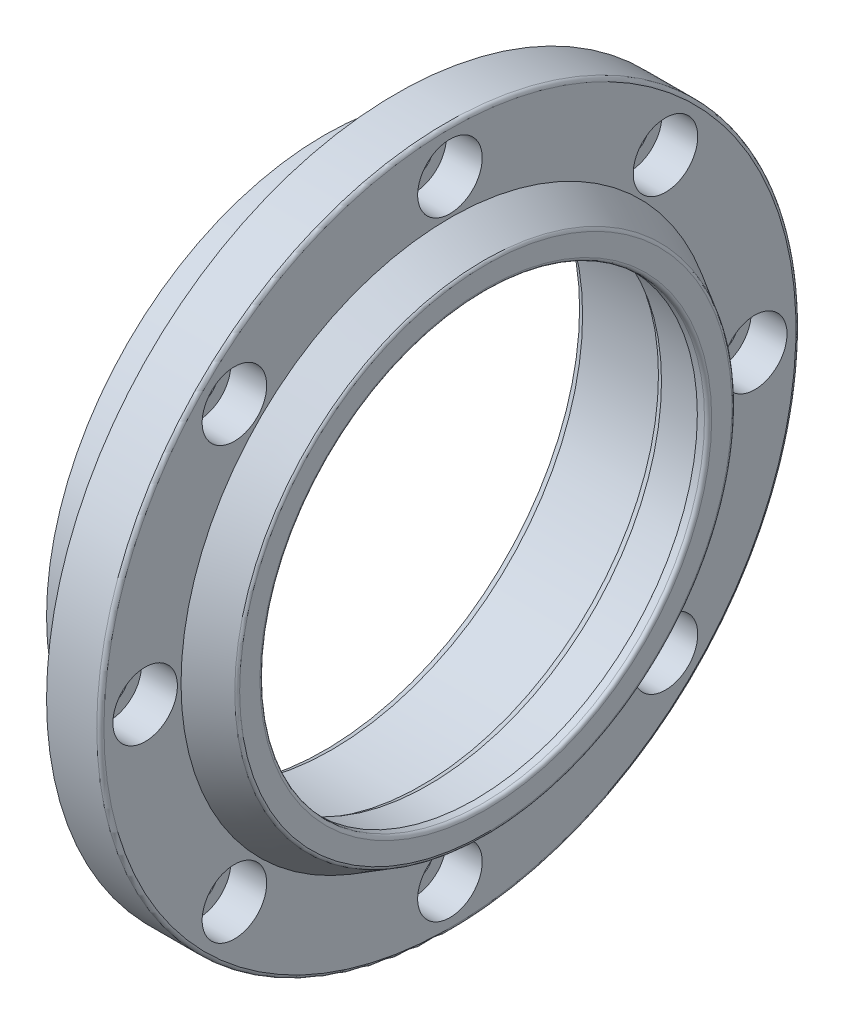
ISO-10303-21;
HEADER;
FILE_DESCRIPTION(('STEP AP214'),'2;1');
FILE_NAME('part.step','',(''),(''),'','','');
FILE_SCHEMA(('AUTOMOTIVE_DESIGN { 1 0 10303 214 1 1 1 1 }'));
ENDSEC;
DATA;
#1=APPLICATION_CONTEXT('core data for automotive mechanical design processes');
#2=APPLICATION_PROTOCOL_DEFINITION('international standard','automotive_design',2000,#1);
#3=PRODUCT_CONTEXT('',#1,'mechanical');
#4=PRODUCT('Part','Part','',(#3));
#5=PRODUCT_RELATED_PRODUCT_CATEGORY('part','',(#4));
#6=PRODUCT_DEFINITION_FORMATION('','',#4);
#7=PRODUCT_DEFINITION_CONTEXT('part definition',#1,'design');
#8=PRODUCT_DEFINITION('design','',#6,#7);
#9=PRODUCT_DEFINITION_SHAPE('','',#8);
#10=(LENGTH_UNIT() NAMED_UNIT(*) SI_UNIT(.MILLI.,.METRE.));
#11=(NAMED_UNIT(*) PLANE_ANGLE_UNIT() SI_UNIT($,.RADIAN.));
#12=(NAMED_UNIT(*) SI_UNIT($,.STERADIAN.) SOLID_ANGLE_UNIT());
#13=UNCERTAINTY_MEASURE_WITH_UNIT(LENGTH_MEASURE(1.E-05),#10,'distance_accuracy_value','');
#14=(GEOMETRIC_REPRESENTATION_CONTEXT(3) GLOBAL_UNCERTAINTY_ASSIGNED_CONTEXT((#13)) GLOBAL_UNIT_ASSIGNED_CONTEXT((#10,
#11,#12)) REPRESENTATION_CONTEXT('',''));
#15=CARTESIAN_POINT('',(0.,0.,0.));
#16=DIRECTION('',(0.,0.,1.));
#17=DIRECTION('',(1.,0.,0.));
#18=AXIS2_PLACEMENT_3D('',#15,#16,#17);
#19=CARTESIAN_POINT('',(35.,75.,0.));
#20=DIRECTION('',(-1.,0.,0.));
#21=DIRECTION('',(0.,0.,1.));
#22=AXIS2_PLACEMENT_3D('',#19,#20,#21);
#23=PLANE('',#22);
#24=CARTESIAN_POINT('',(35.,8.90328257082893E-13,-85.));
#25=DIRECTION('',(1.,0.,0.));
#26=DIRECTION('',(0.,0.,-1.));
#27=AXIS2_PLACEMENT_3D('',#24,#25,#26);
#28=CIRCLE('',#27,9.);
#29=CARTESIAN_POINT('',(35.,8.90328257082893E-13,-94.));
#30=VERTEX_POINT('',#29);
#31=EDGE_CURVE('E80',#30,#30,#28,.T.);
#32=ORIENTED_EDGE('',*,*,#31,.F.);
#33=EDGE_LOOP('',(#32));
#34=FACE_BOUND('',#33,.T.);
#35=CARTESIAN_POINT('',(35.,0.,0.));
#36=DIRECTION('',(-1.,0.,0.));
#37=DIRECTION('',(0.,0.,1.));
#38=AXIS2_PLACEMENT_3D('',#35,#36,#37);
#39=CIRCLE('',#38,75.);
#40=CARTESIAN_POINT('',(35.,0.,75.));
#41=VERTEX_POINT('',#40);
#42=EDGE_CURVE('E155',#41,#41,#39,.T.);
#43=ORIENTED_EDGE('',*,*,#42,.T.);
#44=EDGE_LOOP('',(#43));
#45=FACE_BOUND('',#44,.T.);
#46=CARTESIAN_POINT('',(35.,0.,0.));
#47=DIRECTION('',(-1.,0.,0.));
#48=DIRECTION('',(0.,0.,1.));
#49=AXIS2_PLACEMENT_3D('',#46,#47,#48);
#50=CIRCLE('',#49,96.5);
#51=CARTESIAN_POINT('',(35.,0.,96.5));
#52=VERTEX_POINT('',#51);
#53=EDGE_CURVE('E182',#52,#52,#50,.F.);
#54=ORIENTED_EDGE('',*,*,#53,.T.);
#55=EDGE_LOOP('',(#54));
#56=FACE_BOUND('',#55,.T.);
#57=CARTESIAN_POINT('',(35.,85.,0.));
#58=DIRECTION('',(1.,0.,0.));
#59=DIRECTION('',(0.,0.,-1.));
#60=AXIS2_PLACEMENT_3D('',#57,#58,#59);
#61=CIRCLE('',#60,8.99999999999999);
#62=CARTESIAN_POINT('',(35.,85.,-8.99999999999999));
#63=VERTEX_POINT('',#62);
#64=EDGE_CURVE('E52',#63,#63,#61,.T.);
#65=ORIENTED_EDGE('',*,*,#64,.F.);
#66=EDGE_LOOP('',(#65));
#67=FACE_BOUND('',#66,.T.);
#68=CARTESIAN_POINT('',(35.,60.1040764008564,60.1040764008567));
#69=DIRECTION('',(1.,0.,0.));
#70=DIRECTION('',(0.,0.,-1.));
#71=AXIS2_PLACEMENT_3D('',#68,#69,#70);
#72=CIRCLE('',#71,8.99999999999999);
#73=CARTESIAN_POINT('',(35.,60.1040764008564,51.1040764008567));
#74=VERTEX_POINT('',#73);
#75=EDGE_CURVE('E57',#74,#74,#72,.T.);
#76=ORIENTED_EDGE('',*,*,#75,.F.);
#77=EDGE_LOOP('',(#76));
#78=FACE_BOUND('',#77,.T.);
#79=CARTESIAN_POINT('',(35.,-2.96776085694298E-13,85.));
#80=DIRECTION('',(1.,0.,0.));
#81=DIRECTION('',(0.,0.,-1.));
#82=AXIS2_PLACEMENT_3D('',#79,#80,#81);
#83=CIRCLE('',#82,9.);
#84=CARTESIAN_POINT('',(35.,-2.96776085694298E-13,76.));
#85=VERTEX_POINT('',#84);
#86=EDGE_CURVE('E62',#85,#85,#83,.T.);
#87=ORIENTED_EDGE('',*,*,#86,.F.);
#88=EDGE_LOOP('',(#87));
#89=FACE_BOUND('',#88,.T.);
#90=CARTESIAN_POINT('',(35.,-60.1040764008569,60.1040764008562));
#91=DIRECTION('',(1.,0.,0.));
#92=DIRECTION('',(0.,0.,-1.));
#93=AXIS2_PLACEMENT_3D('',#90,#91,#92);
#94=CIRCLE('',#93,9.);
#95=CARTESIAN_POINT('',(35.,-60.1040764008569,51.1040764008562));
#96=VERTEX_POINT('',#95);
#97=EDGE_CURVE('E67',#96,#96,#94,.T.);
#98=ORIENTED_EDGE('',*,*,#97,.F.);
#99=EDGE_LOOP('',(#98));
#100=FACE_BOUND('',#99,.T.);
#101=CARTESIAN_POINT('',(35.,-85.,-5.93552171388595E-13));
#102=DIRECTION('',(1.,0.,0.));
#103=DIRECTION('',(0.,0.,-1.));
#104=AXIS2_PLACEMENT_3D('',#101,#102,#103);
#105=CIRCLE('',#104,8.99999999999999);
#106=CARTESIAN_POINT('',(35.,-85.,-9.00000000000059));
#107=VERTEX_POINT('',#106);
#108=EDGE_CURVE('E72',#107,#107,#105,.T.);
#109=ORIENTED_EDGE('',*,*,#108,.F.);
#110=EDGE_LOOP('',(#109));
#111=FACE_BOUND('',#110,.T.);
#112=CARTESIAN_POINT('',(35.,-60.104076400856,-60.1040764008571));
#113=DIRECTION('',(1.,0.,0.));
#114=DIRECTION('',(0.,0.,-1.));
#115=AXIS2_PLACEMENT_3D('',#112,#113,#114);
#116=CIRCLE('',#115,9.);
#117=CARTESIAN_POINT('',(35.,-60.104076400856,-69.1040764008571));
#118=VERTEX_POINT('',#117);
#119=EDGE_CURVE('E76',#118,#118,#116,.T.);
#120=ORIENTED_EDGE('',*,*,#119,.F.);
#121=EDGE_LOOP('',(#120));
#122=FACE_BOUND('',#121,.T.);
#123=CARTESIAN_POINT('',(35.,60.1040764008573,-60.1040764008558));
#124=DIRECTION('',(1.,0.,0.));
#125=DIRECTION('',(0.,0.,-1.));
#126=AXIS2_PLACEMENT_3D('',#123,#124,#125);
#127=CIRCLE('',#126,9.);
#128=CARTESIAN_POINT('',(35.,60.1040764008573,-69.1040764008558));
#129=VERTEX_POINT('',#128);
#130=EDGE_CURVE('E351',#129,#129,#127,.T.);
#131=ORIENTED_EDGE('',*,*,#130,.F.);
#132=EDGE_LOOP('',(#131));
#133=FACE_BOUND('',#132,.T.);
#134=ADVANCED_FACE('F31',(#34,#45,#56,#67,#78,#89,#100,#111,#122,#133),#23,.F.);
#135=CARTESIAN_POINT('',(0.,77.5,0.));
#136=DIRECTION('',(1.,0.,0.));
#137=DIRECTION('',(0.,0.,-1.));
#138=AXIS2_PLACEMENT_3D('',#135,#136,#137);
#139=PLANE('',#138);
#140=CARTESIAN_POINT('',(0.,0.,0.));
#141=DIRECTION('',(1.,0.,0.));
#142=DIRECTION('',(0.,0.,-1.));
#143=AXIS2_PLACEMENT_3D('',#140,#141,#142);
#144=CIRCLE('',#143,71.1547005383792);
#145=CARTESIAN_POINT('',(0.,0.,-71.1547005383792));
#146=VERTEX_POINT('',#145);
#147=EDGE_CURVE('E176',#146,#146,#144,.T.);
#148=ORIENTED_EDGE('',*,*,#147,.T.);
#149=EDGE_LOOP('',(#148));
#150=FACE_BOUND('',#149,.T.);
#151=CARTESIAN_POINT('',(0.,0.,0.));
#152=DIRECTION('',(-1.,0.,0.));
#153=DIRECTION('',(0.,0.,1.));
#154=AXIS2_PLACEMENT_3D('',#151,#152,#153);
#155=CIRCLE('',#154,77.5);
#156=CARTESIAN_POINT('',(0.,0.,77.5));
#157=VERTEX_POINT('',#156);
#158=EDGE_CURVE('E51',#157,#157,#155,.T.);
#159=ORIENTED_EDGE('',*,*,#158,.T.);
#160=EDGE_LOOP('',(#159));
#161=FACE_BOUND('',#160,.T.);
#162=ADVANCED_FACE('F33',(#150,#161),#139,.F.);
#163=CARTESIAN_POINT('',(0.,0.,0.));
#164=DIRECTION('',(-1.,0.,0.));
#165=DIRECTION('',(0.,0.,1.));
#166=AXIS2_PLACEMENT_3D('',#163,#164,#165);
#167=CYLINDRICAL_SURFACE('',#166,70.);
#168=CARTESIAN_POINT('',(1.99999999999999,0.,0.));
#169=DIRECTION('',(1.,0.,0.));
#170=DIRECTION('',(0.,0.,-1.));
#171=AXIS2_PLACEMENT_3D('',#168,#169,#170);
#172=CIRCLE('',#171,70.);
#173=CARTESIAN_POINT('',(1.99999999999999,0.,-70.));
#174=VERTEX_POINT('',#173);
#175=EDGE_CURVE('E173',#174,#174,#172,.F.);
#176=ORIENTED_EDGE('',*,*,#175,.T.);
#177=EDGE_LOOP('',(#176));
#178=FACE_BOUND('',#177,.T.);
#179=CARTESIAN_POINT('',(27.,0.,0.));
#180=DIRECTION('',(-1.,0.,0.));
#181=DIRECTION('',(0.,0.,1.));
#182=AXIS2_PLACEMENT_3D('',#179,#180,#181);
#183=CIRCLE('',#182,70.);
#184=CARTESIAN_POINT('',(27.,0.,70.));
#185=VERTEX_POINT('',#184);
#186=EDGE_CURVE('E164',#185,#185,#183,.T.);
#187=ORIENTED_EDGE('',*,*,#186,.F.);
#188=EDGE_LOOP('',(#187));
#189=FACE_BOUND('',#188,.T.);
#190=ADVANCED_FACE('F216',(#178,#189),#167,.F.);
#191=CARTESIAN_POINT('',(27.,70.,0.));
#192=DIRECTION('',(1.,0.,0.));
#193=DIRECTION('',(0.,0.,-1.));
#194=AXIS2_PLACEMENT_3D('',#191,#192,#193);
#195=PLANE('',#194);
#196=CARTESIAN_POINT('',(27.,0.,0.));
#197=DIRECTION('',(1.,0.,0.));
#198=DIRECTION('',(0.,0.,-1.));
#199=AXIS2_PLACEMENT_3D('',#196,#197,#198);
#200=CIRCLE('',#199,66.1547005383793);
#201=CARTESIAN_POINT('',(27.,0.,-66.1547005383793));
#202=VERTEX_POINT('',#201);
#203=EDGE_CURVE('E170',#202,#202,#200,.T.);
#204=ORIENTED_EDGE('',*,*,#203,.T.);
#205=EDGE_LOOP('',(#204));
#206=FACE_BOUND('',#205,.T.);
#207=ORIENTED_EDGE('',*,*,#186,.T.);
#208=EDGE_LOOP('',(#207));
#209=FACE_BOUND('',#208,.T.);
#210=ADVANCED_FACE('F239',(#206,#209),#195,.F.);
#211=CARTESIAN_POINT('',(0.,0.,0.));
#212=DIRECTION('',(-1.,0.,0.));
#213=DIRECTION('',(0.,0.,1.));
#214=AXIS2_PLACEMENT_3D('',#211,#212,#213);
#215=CYLINDRICAL_SURFACE('',#214,65.);
#216=CARTESIAN_POINT('',(29.0000000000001,0.,0.));
#217=DIRECTION('',(1.,0.,0.));
#218=DIRECTION('',(0.,0.,-1.));
#219=AXIS2_PLACEMENT_3D('',#216,#217,#218);
#220=CIRCLE('',#219,65.);
#221=CARTESIAN_POINT('',(29.0000000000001,0.,-65.));
#222=VERTEX_POINT('',#221);
#223=EDGE_CURVE('E167',#222,#222,#220,.F.);
#224=ORIENTED_EDGE('',*,*,#223,.T.);
#225=EDGE_LOOP('',(#224));
#226=FACE_BOUND('',#225,.T.);
#227=CARTESIAN_POINT('',(42.,0.,0.));
#228=DIRECTION('',(-1.,0.,0.));
#229=DIRECTION('',(0.,0.,1.));
#230=AXIS2_PLACEMENT_3D('',#227,#228,#229);
#231=CIRCLE('',#230,65.);
#232=CARTESIAN_POINT('',(42.,0.,65.));
#233=VERTEX_POINT('',#232);
#234=EDGE_CURVE('E161',#233,#233,#231,.T.);
#235=ORIENTED_EDGE('',*,*,#234,.F.);
#236=EDGE_LOOP('',(#235));
#237=FACE_BOUND('',#236,.T.);
#238=ADVANCED_FACE('F235',(#226,#237),#215,.F.);
#239=CARTESIAN_POINT('',(42.,65.,0.));
#240=DIRECTION('',(1.,0.,0.));
#241=DIRECTION('',(0.,0.,-1.));
#242=AXIS2_PLACEMENT_3D('',#239,#240,#241);
#243=PLANE('',#242);
#244=CARTESIAN_POINT('',(42.,0.,0.));
#245=DIRECTION('',(-1.,0.,0.));
#246=DIRECTION('',(0.,0.,1.));
#247=AXIS2_PLACEMENT_3D('',#244,#245,#246);
#248=CIRCLE('',#247,62.);
#249=CARTESIAN_POINT('',(42.,0.,62.));
#250=VERTEX_POINT('',#249);
#251=EDGE_CURVE('E158',#250,#250,#248,.T.);
#252=ORIENTED_EDGE('',*,*,#251,.F.);
#253=EDGE_LOOP('',(#252));
#254=FACE_BOUND('',#253,.T.);
#255=ORIENTED_EDGE('',*,*,#234,.T.);
#256=EDGE_LOOP('',(#255));
#257=FACE_BOUND('',#256,.T.);
#258=ADVANCED_FACE('F231',(#254,#257),#243,.F.);
#259=CARTESIAN_POINT('',(0.,0.,0.));
#260=DIRECTION('',(-1.,0.,0.));
#261=DIRECTION('',(0.,0.,1.));
#262=AXIS2_PLACEMENT_3D('',#259,#260,#261);
#263=CYLINDRICAL_SURFACE('',#262,62.);
#264=CARTESIAN_POINT('',(44.,0.,0.));
#265=DIRECTION('',(-1.,0.,0.));
#266=DIRECTION('',(0.,0.,1.));
#267=AXIS2_PLACEMENT_3D('',#264,#265,#266);
#268=CIRCLE('',#267,62.);
#269=CARTESIAN_POINT('',(44.,0.,62.));
#270=VERTEX_POINT('',#269);
#271=EDGE_CURVE('E39',#270,#270,#268,.F.);
#272=ORIENTED_EDGE('',*,*,#271,.T.);
#273=EDGE_LOOP('',(#272));
#274=FACE_BOUND('',#273,.T.);
#275=ORIENTED_EDGE('',*,*,#251,.T.);
#276=EDGE_LOOP('',(#275));
#277=FACE_BOUND('',#276,.T.);
#278=ADVANCED_FACE('F228',(#274,#277),#263,.F.);
#279=CARTESIAN_POINT('',(45.,62.,0.));
#280=DIRECTION('',(-1.,0.,0.));
#281=DIRECTION('',(0.,0.,1.));
#282=AXIS2_PLACEMENT_3D('',#279,#280,#281);
#283=PLANE('',#282);
#284=CARTESIAN_POINT('',(45.,0.,0.));
#285=DIRECTION('',(-1.,0.,0.));
#286=DIRECTION('',(0.,0.,1.));
#287=AXIS2_PLACEMENT_3D('',#284,#285,#286);
#288=CIRCLE('',#287,63.);
#289=CARTESIAN_POINT('',(45.,0.,63.));
#290=VERTEX_POINT('',#289);
#291=EDGE_CURVE('E44',#290,#290,#288,.T.);
#292=ORIENTED_EDGE('',*,*,#291,.T.);
#293=EDGE_LOOP('',(#292));
#294=FACE_BOUND('',#293,.T.);
#295=CARTESIAN_POINT('',(45.,0.,0.));
#296=DIRECTION('',(-1.,0.,0.));
#297=DIRECTION('',(0.,0.,1.));
#298=AXIS2_PLACEMENT_3D('',#295,#296,#297);
#299=CIRCLE('',#298,68.6491470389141);
#300=CARTESIAN_POINT('',(45.,0.,68.6491470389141));
#301=VERTEX_POINT('',#300);
#302=EDGE_CURVE('E185',#301,#301,#299,.F.);
#303=ORIENTED_EDGE('',*,*,#302,.T.);
#304=EDGE_LOOP('',(#303));
#305=FACE_BOUND('',#304,.T.);
#306=ADVANCED_FACE('F190',(#294,#305),#283,.F.);
#307=CARTESIAN_POINT('',(45.,0.,0.));
#308=DIRECTION('',(-1.,0.,0.));
#309=DIRECTION('',(0.,0.,1.));
#310=AXIS2_PLACEMENT_3D('',#307,#308,#309);
#311=CONICAL_SURFACE('',#310,69.2264973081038,0.523598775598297);
#312=CARTESIAN_POINT('',(44.5,0.,0.));
#313=DIRECTION('',(1.,0.,0.));
#314=DIRECTION('',(0.,0.,-1.));
#315=AXIS2_PLACEMENT_3D('',#312,#313,#314);
#316=CIRCLE('',#315,69.5151724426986);
#317=CARTESIAN_POINT('',(44.5,0.,-69.5151724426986));
#318=VERTEX_POINT('',#317);
#319=EDGE_CURVE('E10',#318,#318,#316,.F.);
#320=ORIENTED_EDGE('',*,*,#319,.T.);
#321=EDGE_LOOP('',(#320));
#322=FACE_BOUND('',#321,.T.);
#323=ORIENTED_EDGE('',*,*,#42,.F.);
#324=EDGE_LOOP('',(#323));
#325=FACE_BOUND('',#324,.T.);
#326=ADVANCED_FACE('F223',(#322,#325),#311,.T.);
#327=CARTESIAN_POINT('',(0.,0.,0.));
#328=DIRECTION('',(-1.,0.,0.));
#329=DIRECTION('',(0.,0.,1.));
#330=AXIS2_PLACEMENT_3D('',#327,#328,#329);
#331=CYLINDRICAL_SURFACE('',#330,97.5);
#332=CARTESIAN_POINT('',(34.,0.,0.));
#333=DIRECTION('',(-1.,0.,0.));
#334=DIRECTION('',(0.,0.,1.));
#335=AXIS2_PLACEMENT_3D('',#332,#333,#334);
#336=CIRCLE('',#335,97.5);
#337=CARTESIAN_POINT('',(34.,0.,97.5));
#338=VERTEX_POINT('',#337);
#339=EDGE_CURVE('E179',#338,#338,#336,.T.);
#340=ORIENTED_EDGE('',*,*,#339,.T.);
#341=EDGE_LOOP('',(#340));
#342=FACE_BOUND('',#341,.T.);
#343=CARTESIAN_POINT('',(20.,0.,0.));
#344=DIRECTION('',(-1.,0.,0.));
#345=DIRECTION('',(0.,0.,1.));
#346=AXIS2_PLACEMENT_3D('',#343,#344,#345);
#347=CIRCLE('',#346,97.5);
#348=CARTESIAN_POINT('',(20.,0.,97.5));
#349=VERTEX_POINT('',#348);
#350=EDGE_CURVE('E152',#349,#349,#347,.T.);
#351=ORIENTED_EDGE('',*,*,#350,.F.);
#352=EDGE_LOOP('',(#351));
#353=FACE_BOUND('',#352,.T.);
#354=ADVANCED_FACE('F221',(#342,#353),#331,.T.);
#355=CARTESIAN_POINT('',(20.,97.5,0.));
#356=DIRECTION('',(1.,0.,0.));
#357=DIRECTION('',(0.,0.,-1.));
#358=AXIS2_PLACEMENT_3D('',#355,#356,#357);
#359=PLANE('',#358);
#360=CARTESIAN_POINT('',(20.,60.1040764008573,-60.1040764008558));
#361=DIRECTION('',(1.,0.,0.));
#362=DIRECTION('',(0.,0.,-1.));
#363=AXIS2_PLACEMENT_3D('',#360,#361,#362);
#364=CIRCLE('',#363,5.5);
#365=CARTESIAN_POINT('',(20.,60.1040764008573,-65.6040764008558));
#366=VERTEX_POINT('',#365);
#367=EDGE_CURVE('E35',#366,#366,#364,.T.);
#368=ORIENTED_EDGE('',*,*,#367,.T.);
#369=EDGE_LOOP('',(#368));
#370=FACE_BOUND('',#369,.T.);
#371=CARTESIAN_POINT('',(20.,8.90328257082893E-13,-85.));
#372=DIRECTION('',(1.,0.,0.));
#373=DIRECTION('',(0.,0.,-1.));
#374=AXIS2_PLACEMENT_3D('',#371,#372,#373);
#375=CIRCLE('',#374,5.5);
#376=CARTESIAN_POINT('',(20.,8.90328257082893E-13,-90.5));
#377=VERTEX_POINT('',#376);
#378=EDGE_CURVE('E77',#377,#377,#375,.T.);
#379=ORIENTED_EDGE('',*,*,#378,.T.);
#380=EDGE_LOOP('',(#379));
#381=FACE_BOUND('',#380,.T.);
#382=CARTESIAN_POINT('',(20.,-60.104076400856,-60.1040764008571));
#383=DIRECTION('',(1.,0.,0.));
#384=DIRECTION('',(0.,0.,-1.));
#385=AXIS2_PLACEMENT_3D('',#382,#383,#384);
#386=CIRCLE('',#385,5.49999999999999);
#387=CARTESIAN_POINT('',(20.,-60.104076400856,-65.6040764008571));
#388=VERTEX_POINT('',#387);
#389=EDGE_CURVE('E73',#388,#388,#386,.T.);
#390=ORIENTED_EDGE('',*,*,#389,.T.);
#391=EDGE_LOOP('',(#390));
#392=FACE_BOUND('',#391,.T.);
#393=CARTESIAN_POINT('',(20.,-85.,-5.93552171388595E-13));
#394=DIRECTION('',(1.,0.,0.));
#395=DIRECTION('',(0.,0.,-1.));
#396=AXIS2_PLACEMENT_3D('',#393,#394,#395);
#397=CIRCLE('',#396,5.5);
#398=CARTESIAN_POINT('',(20.,-85.,-5.50000000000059));
#399=VERTEX_POINT('',#398);
#400=EDGE_CURVE('E68',#399,#399,#397,.T.);
#401=ORIENTED_EDGE('',*,*,#400,.T.);
#402=EDGE_LOOP('',(#401));
#403=FACE_BOUND('',#402,.T.);
#404=CARTESIAN_POINT('',(20.,-60.1040764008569,60.1040764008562));
#405=DIRECTION('',(1.,0.,0.));
#406=DIRECTION('',(0.,0.,-1.));
#407=AXIS2_PLACEMENT_3D('',#404,#405,#406);
#408=CIRCLE('',#407,5.49999999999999);
#409=CARTESIAN_POINT('',(20.,-60.1040764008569,54.6040764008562));
#410=VERTEX_POINT('',#409);
#411=EDGE_CURVE('E63',#410,#410,#408,.T.);
#412=ORIENTED_EDGE('',*,*,#411,.T.);
#413=EDGE_LOOP('',(#412));
#414=FACE_BOUND('',#413,.T.);
#415=CARTESIAN_POINT('',(20.,-2.96776085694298E-13,85.));
#416=DIRECTION('',(1.,0.,0.));
#417=DIRECTION('',(0.,0.,-1.));
#418=AXIS2_PLACEMENT_3D('',#415,#416,#417);
#419=CIRCLE('',#418,5.5);
#420=CARTESIAN_POINT('',(20.,-2.96776085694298E-13,79.5));
#421=VERTEX_POINT('',#420);
#422=EDGE_CURVE('E58',#421,#421,#419,.T.);
#423=ORIENTED_EDGE('',*,*,#422,.T.);
#424=EDGE_LOOP('',(#423));
#425=FACE_BOUND('',#424,.T.);
#426=CARTESIAN_POINT('',(20.,60.1040764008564,60.1040764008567));
#427=DIRECTION('',(1.,0.,0.));
#428=DIRECTION('',(0.,0.,-1.));
#429=AXIS2_PLACEMENT_3D('',#426,#427,#428);
#430=CIRCLE('',#429,5.5);
#431=CARTESIAN_POINT('',(20.,60.1040764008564,54.6040764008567));
#432=VERTEX_POINT('',#431);
#433=EDGE_CURVE('E53',#432,#432,#430,.T.);
#434=ORIENTED_EDGE('',*,*,#433,.T.);
#435=EDGE_LOOP('',(#434));
#436=FACE_BOUND('',#435,.T.);
#437=CARTESIAN_POINT('',(20.,85.,0.));
#438=DIRECTION('',(1.,0.,0.));
#439=DIRECTION('',(0.,0.,-1.));
#440=AXIS2_PLACEMENT_3D('',#437,#438,#439);
#441=CIRCLE('',#440,5.5);
#442=CARTESIAN_POINT('',(20.,85.,-5.5));
#443=VERTEX_POINT('',#442);
#444=EDGE_CURVE('E48',#443,#443,#441,.T.);
#445=ORIENTED_EDGE('',*,*,#444,.T.);
#446=EDGE_LOOP('',(#445));
#447=FACE_BOUND('',#446,.T.);
#448=CARTESIAN_POINT('',(20.,0.,0.));
#449=DIRECTION('',(-1.,0.,0.));
#450=DIRECTION('',(0.,0.,1.));
#451=AXIS2_PLACEMENT_3D('',#448,#449,#450);
#452=CIRCLE('',#451,77.5);
#453=CARTESIAN_POINT('',(20.,0.,77.5));
#454=VERTEX_POINT('',#453);
#455=EDGE_CURVE('E149',#454,#454,#452,.T.);
#456=ORIENTED_EDGE('',*,*,#455,.F.);
#457=EDGE_LOOP('',(#456));
#458=FACE_BOUND('',#457,.T.);
#459=ORIENTED_EDGE('',*,*,#350,.T.);
#460=EDGE_LOOP('',(#459));
#461=FACE_BOUND('',#460,.T.);
#462=ADVANCED_FACE('F281',(#370,#381,#392,#403,#414,#425,#436,#447,#458,#461),#359,.F.);
#463=CARTESIAN_POINT('',(0.,0.,0.));
#464=DIRECTION('',(-1.,0.,0.));
#465=DIRECTION('',(0.,0.,1.));
#466=AXIS2_PLACEMENT_3D('',#463,#464,#465);
#467=CYLINDRICAL_SURFACE('',#466,77.5);
#468=CARTESIAN_POINT('',(11.8,0.,0.));
#469=DIRECTION('',(-1.,0.,0.));
#470=DIRECTION('',(0.,0.,1.));
#471=AXIS2_PLACEMENT_3D('',#468,#469,#470);
#472=CIRCLE('',#471,77.5);
#473=CARTESIAN_POINT('',(11.8,0.,77.5));
#474=VERTEX_POINT('',#473);
#475=EDGE_CURVE('E146',#474,#474,#472,.T.);
#476=ORIENTED_EDGE('',*,*,#475,.F.);
#477=EDGE_LOOP('',(#476));
#478=FACE_BOUND('',#477,.T.);
#479=ORIENTED_EDGE('',*,*,#455,.T.);
#480=EDGE_LOOP('',(#479));
#481=FACE_BOUND('',#480,.T.);
#482=ADVANCED_FACE('F278',(#478,#481),#467,.T.);
#483=CARTESIAN_POINT('',(11.8,77.5,0.));
#484=DIRECTION('',(1.,0.,0.));
#485=DIRECTION('',(0.,0.,-1.));
#486=AXIS2_PLACEMENT_3D('',#483,#484,#485);
#487=PLANE('',#486);
#488=CARTESIAN_POINT('',(11.8,0.,0.));
#489=DIRECTION('',(-1.,0.,0.));
#490=DIRECTION('',(0.,0.,1.));
#491=AXIS2_PLACEMENT_3D('',#488,#489,#490);
#492=CIRCLE('',#491,74.4);
#493=CARTESIAN_POINT('',(11.8,0.,74.4));
#494=VERTEX_POINT('',#493);
#495=EDGE_CURVE('E143',#494,#494,#492,.T.);
#496=ORIENTED_EDGE('',*,*,#495,.F.);
#497=EDGE_LOOP('',(#496));
#498=FACE_BOUND('',#497,.T.);
#499=ORIENTED_EDGE('',*,*,#475,.T.);
#500=EDGE_LOOP('',(#499));
#501=FACE_BOUND('',#500,.T.);
#502=ADVANCED_FACE('F274',(#498,#501),#487,.F.);
#503=CARTESIAN_POINT('',(0.,0.,0.));
#504=DIRECTION('',(-1.,0.,0.));
#505=DIRECTION('',(0.,0.,1.));
#506=AXIS2_PLACEMENT_3D('',#503,#504,#505);
#507=CYLINDRICAL_SURFACE('',#506,74.4);
#508=CARTESIAN_POINT('',(7.,0.,0.));
#509=DIRECTION('',(-1.,0.,0.));
#510=DIRECTION('',(0.,0.,1.));
#511=AXIS2_PLACEMENT_3D('',#508,#509,#510);
#512=CIRCLE('',#511,74.4);
#513=CARTESIAN_POINT('',(7.,0.,74.4));
#514=VERTEX_POINT('',#513);
#515=EDGE_CURVE('E140',#514,#514,#512,.T.);
#516=ORIENTED_EDGE('',*,*,#515,.F.);
#517=EDGE_LOOP('',(#516));
#518=FACE_BOUND('',#517,.T.);
#519=ORIENTED_EDGE('',*,*,#495,.T.);
#520=EDGE_LOOP('',(#519));
#521=FACE_BOUND('',#520,.T.);
#522=ADVANCED_FACE('F270',(#518,#521),#507,.T.);
#523=CARTESIAN_POINT('',(7.,74.4,0.));
#524=DIRECTION('',(-1.,0.,0.));
#525=DIRECTION('',(0.,0.,1.));
#526=AXIS2_PLACEMENT_3D('',#523,#524,#525);
#527=PLANE('',#526);
#528=CARTESIAN_POINT('',(7.,0.,0.));
#529=DIRECTION('',(-1.,0.,0.));
#530=DIRECTION('',(0.,0.,1.));
#531=AXIS2_PLACEMENT_3D('',#528,#529,#530);
#532=CIRCLE('',#531,77.5);
#533=CARTESIAN_POINT('',(7.,0.,77.5));
#534=VERTEX_POINT('',#533);
#535=EDGE_CURVE('E137',#534,#534,#532,.T.);
#536=ORIENTED_EDGE('',*,*,#535,.F.);
#537=EDGE_LOOP('',(#536));
#538=FACE_BOUND('',#537,.T.);
#539=ORIENTED_EDGE('',*,*,#515,.T.);
#540=EDGE_LOOP('',(#539));
#541=FACE_BOUND('',#540,.T.);
#542=ADVANCED_FACE('F266',(#538,#541),#527,.F.);
#543=CARTESIAN_POINT('',(0.,0.,0.));
#544=DIRECTION('',(-1.,0.,0.));
#545=DIRECTION('',(0.,0.,1.));
#546=AXIS2_PLACEMENT_3D('',#543,#544,#545);
#547=CYLINDRICAL_SURFACE('',#546,77.5);
#548=ORIENTED_EDGE('',*,*,#158,.F.);
#549=EDGE_LOOP('',(#548));
#550=FACE_BOUND('',#549,.T.);
#551=ORIENTED_EDGE('',*,*,#535,.T.);
#552=EDGE_LOOP('',(#551));
#553=FACE_BOUND('',#552,.T.);
#554=ADVANCED_FACE('F259',(#550,#553),#547,.T.);
#555=CARTESIAN_POINT('',(29.0000000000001,0.,0.));
#556=DIRECTION('',(-1.,0.,0.));
#557=DIRECTION('',(0.,0.,1.));
#558=AXIS2_PLACEMENT_3D('',#555,#556,#557);
#559=CONICAL_SURFACE('',#558,65.,0.523598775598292);
#560=ORIENTED_EDGE('',*,*,#203,.F.);
#561=EDGE_LOOP('',(#560));
#562=FACE_BOUND('',#561,.T.);
#563=ORIENTED_EDGE('',*,*,#223,.F.);
#564=EDGE_LOOP('',(#563));
#565=FACE_BOUND('',#564,.T.);
#566=ADVANCED_FACE('F253',(#562,#565),#559,.F.);
#567=CARTESIAN_POINT('',(1.99999999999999,0.,0.));
#568=DIRECTION('',(-1.,0.,0.));
#569=DIRECTION('',(0.,0.,1.));
#570=AXIS2_PLACEMENT_3D('',#567,#568,#569);
#571=CONICAL_SURFACE('',#570,70.,0.523598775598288);
#572=ORIENTED_EDGE('',*,*,#147,.F.);
#573=EDGE_LOOP('',(#572));
#574=FACE_BOUND('',#573,.T.);
#575=ORIENTED_EDGE('',*,*,#175,.F.);
#576=EDGE_LOOP('',(#575));
#577=FACE_BOUND('',#576,.T.);
#578=ADVANCED_FACE('F206',(#574,#577),#571,.F.);
#579=CARTESIAN_POINT('',(34.,0.,0.));
#580=DIRECTION('',(-1.,0.,0.));
#581=DIRECTION('',(0.,0.,1.));
#582=AXIS2_PLACEMENT_3D('',#579,#580,#581);
#583=TOROIDAL_SURFACE('',#582,96.5,1.);
#584=ORIENTED_EDGE('',*,*,#53,.F.);
#585=EDGE_LOOP('',(#584));
#586=FACE_BOUND('',#585,.T.);
#587=ORIENTED_EDGE('',*,*,#339,.F.);
#588=EDGE_LOOP('',(#587));
#589=FACE_BOUND('',#588,.T.);
#590=ADVANCED_FACE('F196',(#586,#589),#583,.T.);
#591=CARTESIAN_POINT('',(44.,0.,0.));
#592=DIRECTION('',(-1.,0.,0.));
#593=DIRECTION('',(0.,0.,1.));
#594=AXIS2_PLACEMENT_3D('',#591,#592,#593);
#595=TOROIDAL_SURFACE('',#594,63.,1.);
#596=ORIENTED_EDGE('',*,*,#271,.F.);
#597=EDGE_LOOP('',(#596));
#598=FACE_BOUND('',#597,.T.);
#599=ORIENTED_EDGE('',*,*,#291,.F.);
#600=EDGE_LOOP('',(#599));
#601=FACE_BOUND('',#600,.T.);
#602=ADVANCED_FACE('F193',(#598,#601),#595,.T.);
#603=CARTESIAN_POINT('',(44.,0.,0.));
#604=DIRECTION('',(-1.,0.,0.));
#605=DIRECTION('',(0.,0.,1.));
#606=AXIS2_PLACEMENT_3D('',#603,#604,#605);
#607=TOROIDAL_SURFACE('',#606,68.6491470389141,1.);
#608=ORIENTED_EDGE('',*,*,#302,.F.);
#609=EDGE_LOOP('',(#608));
#610=FACE_BOUND('',#609,.T.);
#611=ORIENTED_EDGE('',*,*,#319,.F.);
#612=EDGE_LOOP('',(#611));
#613=FACE_BOUND('',#612,.T.);
#614=ADVANCED_FACE('F195',(#610,#613),#607,.T.);
#615=CARTESIAN_POINT('',(35.,85.,0.));
#616=DIRECTION('',(1.,0.,0.));
#617=DIRECTION('',(0.,0.,-1.));
#618=AXIS2_PLACEMENT_3D('',#615,#616,#617);
#619=CYLINDRICAL_SURFACE('',#618,5.5);
#620=CARTESIAN_POINT('',(25.,85.,0.));
#621=DIRECTION('',(1.,0.,0.));
#622=DIRECTION('',(0.,0.,-1.));
#623=AXIS2_PLACEMENT_3D('',#620,#621,#622);
#624=CIRCLE('',#623,5.50000000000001);
#625=CARTESIAN_POINT('',(25.,85.,-5.50000000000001));
#626=VERTEX_POINT('',#625);
#627=EDGE_CURVE('E56',#626,#626,#624,.T.);
#628=ORIENTED_EDGE('',*,*,#627,.T.);
#629=EDGE_LOOP('',(#628));
#630=FACE_BOUND('',#629,.T.);
#631=ORIENTED_EDGE('',*,*,#444,.F.);
#632=EDGE_LOOP('',(#631));
#633=FACE_BOUND('',#632,.T.);
#634=ADVANCED_FACE('F203',(#630,#633),#619,.F.);
#635=CARTESIAN_POINT('',(35.,85.,0.));
#636=DIRECTION('',(1.,0.,0.));
#637=DIRECTION('',(0.,0.,-1.));
#638=AXIS2_PLACEMENT_3D('',#635,#636,#637);
#639=CYLINDRICAL_SURFACE('',#638,8.99999999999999);
#640=CARTESIAN_POINT('',(25.,85.,0.));
#641=DIRECTION('',(1.,0.,0.));
#642=DIRECTION('',(0.,0.,-1.));
#643=AXIS2_PLACEMENT_3D('',#640,#641,#642);
#644=CIRCLE('',#643,8.99999999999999);
#645=CARTESIAN_POINT('',(25.,85.,-8.99999999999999));
#646=VERTEX_POINT('',#645);
#647=EDGE_CURVE('E130',#646,#646,#644,.T.);
#648=ORIENTED_EDGE('',*,*,#647,.F.);
#649=EDGE_LOOP('',(#648));
#650=FACE_BOUND('',#649,.T.);
#651=ORIENTED_EDGE('',*,*,#64,.T.);
#652=EDGE_LOOP('',(#651));
#653=FACE_BOUND('',#652,.T.);
#654=ADVANCED_FACE('F311',(#650,#653),#639,.F.);
#655=CARTESIAN_POINT('',(25.,90.5,0.));
#656=DIRECTION('',(-1.,0.,0.));
#657=DIRECTION('',(0.,0.,1.));
#658=AXIS2_PLACEMENT_3D('',#655,#656,#657);
#659=PLANE('',#658);
#660=ORIENTED_EDGE('',*,*,#627,.F.);
#661=EDGE_LOOP('',(#660));
#662=FACE_BOUND('',#661,.T.);
#663=ORIENTED_EDGE('',*,*,#647,.T.);
#664=EDGE_LOOP('',(#663));
#665=FACE_BOUND('',#664,.T.);
#666=ADVANCED_FACE('F317',(#662,#665),#659,.F.);
#667=CARTESIAN_POINT('',(35.,60.1040764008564,60.1040764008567));
#668=DIRECTION('',(1.,0.,0.));
#669=DIRECTION('',(0.,0.,-1.));
#670=AXIS2_PLACEMENT_3D('',#667,#668,#669);
#671=CYLINDRICAL_SURFACE('',#670,5.5);
#672=CARTESIAN_POINT('',(25.,60.1040764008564,60.1040764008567));
#673=DIRECTION('',(1.,0.,0.));
#674=DIRECTION('',(0.,0.,-1.));
#675=AXIS2_PLACEMENT_3D('',#672,#673,#674);
#676=CIRCLE('',#675,5.50000000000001);
#677=CARTESIAN_POINT('',(25.,60.1040764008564,54.6040764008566));
#678=VERTEX_POINT('',#677);
#679=EDGE_CURVE('E61',#678,#678,#676,.T.);
#680=ORIENTED_EDGE('',*,*,#679,.T.);
#681=EDGE_LOOP('',(#680));
#682=FACE_BOUND('',#681,.T.);
#683=ORIENTED_EDGE('',*,*,#433,.F.);
#684=EDGE_LOOP('',(#683));
#685=FACE_BOUND('',#684,.T.);
#686=ADVANCED_FACE('F325',(#682,#685),#671,.F.);
#687=CARTESIAN_POINT('',(35.,60.1040764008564,60.1040764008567));
#688=DIRECTION('',(1.,0.,0.));
#689=DIRECTION('',(0.,0.,-1.));
#690=AXIS2_PLACEMENT_3D('',#687,#688,#689);
#691=CYLINDRICAL_SURFACE('',#690,8.99999999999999);
#692=CARTESIAN_POINT('',(25.,60.1040764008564,60.1040764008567));
#693=DIRECTION('',(1.,0.,0.));
#694=DIRECTION('',(0.,0.,-1.));
#695=AXIS2_PLACEMENT_3D('',#692,#693,#694);
#696=CIRCLE('',#695,8.99999999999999);
#697=CARTESIAN_POINT('',(25.,60.1040764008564,51.1040764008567));
#698=VERTEX_POINT('',#697);
#699=EDGE_CURVE('E123',#698,#698,#696,.T.);
#700=ORIENTED_EDGE('',*,*,#699,.F.);
#701=EDGE_LOOP('',(#700));
#702=FACE_BOUND('',#701,.T.);
#703=ORIENTED_EDGE('',*,*,#75,.T.);
#704=EDGE_LOOP('',(#703));
#705=FACE_BOUND('',#704,.T.);
#706=ADVANCED_FACE('F322',(#702,#705),#691,.F.);
#707=CARTESIAN_POINT('',(25.,65.6040764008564,60.1040764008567));
#708=DIRECTION('',(-1.,0.,0.));
#709=DIRECTION('',(0.,0.,1.));
#710=AXIS2_PLACEMENT_3D('',#707,#708,#709);
#711=PLANE('',#710);
#712=ORIENTED_EDGE('',*,*,#679,.F.);
#713=EDGE_LOOP('',(#712));
#714=FACE_BOUND('',#713,.T.);
#715=ORIENTED_EDGE('',*,*,#699,.T.);
#716=EDGE_LOOP('',(#715));
#717=FACE_BOUND('',#716,.T.);
#718=ADVANCED_FACE('F421',(#714,#717),#711,.F.);
#719=CARTESIAN_POINT('',(35.,-2.96776085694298E-13,85.));
#720=DIRECTION('',(1.,0.,0.));
#721=DIRECTION('',(0.,0.,-1.));
#722=AXIS2_PLACEMENT_3D('',#719,#720,#721);
#723=CYLINDRICAL_SURFACE('',#722,5.5);
#724=CARTESIAN_POINT('',(25.,-2.96776085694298E-13,85.));
#725=DIRECTION('',(1.,0.,0.));
#726=DIRECTION('',(0.,0.,-1.));
#727=AXIS2_PLACEMENT_3D('',#724,#725,#726);
#728=CIRCLE('',#727,5.5);
#729=CARTESIAN_POINT('',(25.,-2.96776085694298E-13,79.5));
#730=VERTEX_POINT('',#729);
#731=EDGE_CURVE('E66',#730,#730,#728,.T.);
#732=ORIENTED_EDGE('',*,*,#731,.T.);
#733=EDGE_LOOP('',(#732));
#734=FACE_BOUND('',#733,.T.);
#735=ORIENTED_EDGE('',*,*,#422,.F.);
#736=EDGE_LOOP('',(#735));
#737=FACE_BOUND('',#736,.T.);
#738=ADVANCED_FACE('F417',(#734,#737),#723,.F.);
#739=CARTESIAN_POINT('',(35.,-2.96776085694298E-13,85.));
#740=DIRECTION('',(1.,0.,0.));
#741=DIRECTION('',(0.,0.,-1.));
#742=AXIS2_PLACEMENT_3D('',#739,#740,#741);
#743=CYLINDRICAL_SURFACE('',#742,9.);
#744=CARTESIAN_POINT('',(25.,-2.96776085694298E-13,85.));
#745=DIRECTION('',(1.,0.,0.));
#746=DIRECTION('',(0.,0.,-1.));
#747=AXIS2_PLACEMENT_3D('',#744,#745,#746);
#748=CIRCLE('',#747,9.);
#749=CARTESIAN_POINT('',(25.,-2.96776085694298E-13,76.));
#750=VERTEX_POINT('',#749);
#751=EDGE_CURVE('E116',#750,#750,#748,.T.);
#752=ORIENTED_EDGE('',*,*,#751,.F.);
#753=EDGE_LOOP('',(#752));
#754=FACE_BOUND('',#753,.T.);
#755=ORIENTED_EDGE('',*,*,#86,.T.);
#756=EDGE_LOOP('',(#755));
#757=FACE_BOUND('',#756,.T.);
#758=ADVANCED_FACE('F420',(#754,#757),#743,.F.);
#759=CARTESIAN_POINT('',(25.,5.4999999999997,85.));
#760=DIRECTION('',(-1.,0.,0.));
#761=DIRECTION('',(0.,0.,1.));
#762=AXIS2_PLACEMENT_3D('',#759,#760,#761);
#763=PLANE('',#762);
#764=ORIENTED_EDGE('',*,*,#731,.F.);
#765=EDGE_LOOP('',(#764));
#766=FACE_BOUND('',#765,.T.);
#767=ORIENTED_EDGE('',*,*,#751,.T.);
#768=EDGE_LOOP('',(#767));
#769=FACE_BOUND('',#768,.T.);
#770=ADVANCED_FACE('F409',(#766,#769),#763,.F.);
#771=CARTESIAN_POINT('',(35.,-60.1040764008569,60.1040764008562));
#772=DIRECTION('',(1.,0.,0.));
#773=DIRECTION('',(0.,0.,-1.));
#774=AXIS2_PLACEMENT_3D('',#771,#772,#773);
#775=CYLINDRICAL_SURFACE('',#774,5.49999999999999);
#776=CARTESIAN_POINT('',(25.,-60.1040764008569,60.1040764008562));
#777=DIRECTION('',(1.,0.,0.));
#778=DIRECTION('',(0.,0.,-1.));
#779=AXIS2_PLACEMENT_3D('',#776,#777,#778);
#780=CIRCLE('',#779,5.5);
#781=CARTESIAN_POINT('',(25.,-60.1040764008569,54.6040764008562));
#782=VERTEX_POINT('',#781);
#783=EDGE_CURVE('E71',#782,#782,#780,.T.);
#784=ORIENTED_EDGE('',*,*,#783,.T.);
#785=EDGE_LOOP('',(#784));
#786=FACE_BOUND('',#785,.T.);
#787=ORIENTED_EDGE('',*,*,#411,.F.);
#788=EDGE_LOOP('',(#787));
#789=FACE_BOUND('',#788,.T.);
#790=ADVANCED_FACE('F405',(#786,#789),#775,.F.);
#791=CARTESIAN_POINT('',(35.,-60.1040764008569,60.1040764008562));
#792=DIRECTION('',(1.,0.,0.));
#793=DIRECTION('',(0.,0.,-1.));
#794=AXIS2_PLACEMENT_3D('',#791,#792,#793);
#795=CYLINDRICAL_SURFACE('',#794,9.);
#796=CARTESIAN_POINT('',(25.,-60.1040764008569,60.1040764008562));
#797=DIRECTION('',(1.,0.,0.));
#798=DIRECTION('',(0.,0.,-1.));
#799=AXIS2_PLACEMENT_3D('',#796,#797,#798);
#800=CIRCLE('',#799,9.);
#801=CARTESIAN_POINT('',(25.,-60.1040764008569,51.1040764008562));
#802=VERTEX_POINT('',#801);
#803=EDGE_CURVE('E109',#802,#802,#800,.T.);
#804=ORIENTED_EDGE('',*,*,#803,.F.);
#805=EDGE_LOOP('',(#804));
#806=FACE_BOUND('',#805,.T.);
#807=ORIENTED_EDGE('',*,*,#97,.T.);
#808=EDGE_LOOP('',(#807));
#809=FACE_BOUND('',#808,.T.);
#810=ADVANCED_FACE('F408',(#806,#809),#795,.F.);
#811=CARTESIAN_POINT('',(25.,-54.6040764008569,60.1040764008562));
#812=DIRECTION('',(-1.,0.,0.));
#813=DIRECTION('',(0.,0.,1.));
#814=AXIS2_PLACEMENT_3D('',#811,#812,#813);
#815=PLANE('',#814);
#816=ORIENTED_EDGE('',*,*,#783,.F.);
#817=EDGE_LOOP('',(#816));
#818=FACE_BOUND('',#817,.T.);
#819=ORIENTED_EDGE('',*,*,#803,.T.);
#820=EDGE_LOOP('',(#819));
#821=FACE_BOUND('',#820,.T.);
#822=ADVANCED_FACE('F397',(#818,#821),#815,.F.);
#823=CARTESIAN_POINT('',(35.,-85.,-5.93552171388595E-13));
#824=DIRECTION('',(1.,0.,0.));
#825=DIRECTION('',(0.,0.,-1.));
#826=AXIS2_PLACEMENT_3D('',#823,#824,#825);
#827=CYLINDRICAL_SURFACE('',#826,5.5);
#828=CARTESIAN_POINT('',(25.,-85.,-5.93552171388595E-13));
#829=DIRECTION('',(1.,0.,0.));
#830=DIRECTION('',(0.,0.,-1.));
#831=AXIS2_PLACEMENT_3D('',#828,#829,#830);
#832=CIRCLE('',#831,5.50000000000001);
#833=CARTESIAN_POINT('',(25.,-85.,-5.5000000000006));
#834=VERTEX_POINT('',#833);
#835=EDGE_CURVE('E75',#834,#834,#832,.T.);
#836=ORIENTED_EDGE('',*,*,#835,.T.);
#837=EDGE_LOOP('',(#836));
#838=FACE_BOUND('',#837,.T.);
#839=ORIENTED_EDGE('',*,*,#400,.F.);
#840=EDGE_LOOP('',(#839));
#841=FACE_BOUND('',#840,.T.);
#842=ADVANCED_FACE('F393',(#838,#841),#827,.F.);
#843=CARTESIAN_POINT('',(35.,-85.,-5.93552171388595E-13));
#844=DIRECTION('',(1.,0.,0.));
#845=DIRECTION('',(0.,0.,-1.));
#846=AXIS2_PLACEMENT_3D('',#843,#844,#845);
#847=CYLINDRICAL_SURFACE('',#846,8.99999999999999);
#848=CARTESIAN_POINT('',(25.,-85.,-5.93552171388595E-13));
#849=DIRECTION('',(1.,0.,0.));
#850=DIRECTION('',(0.,0.,-1.));
#851=AXIS2_PLACEMENT_3D('',#848,#849,#850);
#852=CIRCLE('',#851,8.99999999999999);
#853=CARTESIAN_POINT('',(25.,-85.,-9.00000000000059));
#854=VERTEX_POINT('',#853);
#855=EDGE_CURVE('E102',#854,#854,#852,.T.);
#856=ORIENTED_EDGE('',*,*,#855,.F.);
#857=EDGE_LOOP('',(#856));
#858=FACE_BOUND('',#857,.T.);
#859=ORIENTED_EDGE('',*,*,#108,.T.);
#860=EDGE_LOOP('',(#859));
#861=FACE_BOUND('',#860,.T.);
#862=ADVANCED_FACE('F396',(#858,#861),#847,.F.);
#863=CARTESIAN_POINT('',(25.,-79.5,-5.93552171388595E-13));
#864=DIRECTION('',(-1.,0.,0.));
#865=DIRECTION('',(0.,0.,1.));
#866=AXIS2_PLACEMENT_3D('',#863,#864,#865);
#867=PLANE('',#866);
#868=ORIENTED_EDGE('',*,*,#835,.F.);
#869=EDGE_LOOP('',(#868));
#870=FACE_BOUND('',#869,.T.);
#871=ORIENTED_EDGE('',*,*,#855,.T.);
#872=EDGE_LOOP('',(#871));
#873=FACE_BOUND('',#872,.T.);
#874=ADVANCED_FACE('F385',(#870,#873),#867,.F.);
#875=CARTESIAN_POINT('',(35.,-60.104076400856,-60.1040764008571));
#876=DIRECTION('',(1.,0.,0.));
#877=DIRECTION('',(0.,0.,-1.));
#878=AXIS2_PLACEMENT_3D('',#875,#876,#877);
#879=CYLINDRICAL_SURFACE('',#878,5.49999999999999);
#880=CARTESIAN_POINT('',(25.,-60.104076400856,-60.1040764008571));
#881=DIRECTION('',(1.,0.,0.));
#882=DIRECTION('',(0.,0.,-1.));
#883=AXIS2_PLACEMENT_3D('',#880,#881,#882);
#884=CIRCLE('',#883,5.5);
#885=CARTESIAN_POINT('',(25.,-60.104076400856,-65.6040764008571));
#886=VERTEX_POINT('',#885);
#887=EDGE_CURVE('E79',#886,#886,#884,.T.);
#888=ORIENTED_EDGE('',*,*,#887,.T.);
#889=EDGE_LOOP('',(#888));
#890=FACE_BOUND('',#889,.T.);
#891=ORIENTED_EDGE('',*,*,#389,.F.);
#892=EDGE_LOOP('',(#891));
#893=FACE_BOUND('',#892,.T.);
#894=ADVANCED_FACE('F381',(#890,#893),#879,.F.);
#895=CARTESIAN_POINT('',(35.,-60.104076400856,-60.1040764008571));
#896=DIRECTION('',(1.,0.,0.));
#897=DIRECTION('',(0.,0.,-1.));
#898=AXIS2_PLACEMENT_3D('',#895,#896,#897);
#899=CYLINDRICAL_SURFACE('',#898,9.);
#900=CARTESIAN_POINT('',(25.,-60.104076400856,-60.1040764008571));
#901=DIRECTION('',(1.,0.,0.));
#902=DIRECTION('',(0.,0.,-1.));
#903=AXIS2_PLACEMENT_3D('',#900,#901,#902);
#904=CIRCLE('',#903,8.99999999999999);
#905=CARTESIAN_POINT('',(25.,-60.104076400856,-69.1040764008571));
#906=VERTEX_POINT('',#905);
#907=EDGE_CURVE('E84',#906,#906,#904,.T.);
#908=ORIENTED_EDGE('',*,*,#907,.F.);
#909=EDGE_LOOP('',(#908));
#910=FACE_BOUND('',#909,.T.);
#911=ORIENTED_EDGE('',*,*,#119,.T.);
#912=EDGE_LOOP('',(#911));
#913=FACE_BOUND('',#912,.T.);
#914=ADVANCED_FACE('F384',(#910,#913),#899,.F.);
#915=CARTESIAN_POINT('',(25.,-54.604076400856,-60.1040764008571));
#916=DIRECTION('',(-1.,0.,0.));
#917=DIRECTION('',(0.,0.,1.));
#918=AXIS2_PLACEMENT_3D('',#915,#916,#917);
#919=PLANE('',#918);
#920=ORIENTED_EDGE('',*,*,#887,.F.);
#921=EDGE_LOOP('',(#920));
#922=FACE_BOUND('',#921,.T.);
#923=ORIENTED_EDGE('',*,*,#907,.T.);
#924=EDGE_LOOP('',(#923));
#925=FACE_BOUND('',#924,.T.);
#926=ADVANCED_FACE('F378',(#922,#925),#919,.F.);
#927=CARTESIAN_POINT('',(35.,8.90328257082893E-13,-85.));
#928=DIRECTION('',(1.,0.,0.));
#929=DIRECTION('',(0.,0.,-1.));
#930=AXIS2_PLACEMENT_3D('',#927,#928,#929);
#931=CYLINDRICAL_SURFACE('',#930,5.5);
#932=CARTESIAN_POINT('',(25.,8.90328257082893E-13,-85.));
#933=DIRECTION('',(1.,0.,0.));
#934=DIRECTION('',(0.,0.,-1.));
#935=AXIS2_PLACEMENT_3D('',#932,#933,#934);
#936=CIRCLE('',#935,5.5);
#937=CARTESIAN_POINT('',(25.,8.90328257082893E-13,-90.5));
#938=VERTEX_POINT('',#937);
#939=EDGE_CURVE('E92',#938,#938,#936,.T.);
#940=ORIENTED_EDGE('',*,*,#939,.T.);
#941=EDGE_LOOP('',(#940));
#942=FACE_BOUND('',#941,.T.);
#943=ORIENTED_EDGE('',*,*,#378,.F.);
#944=EDGE_LOOP('',(#943));
#945=FACE_BOUND('',#944,.T.);
#946=ADVANCED_FACE('F362',(#942,#945),#931,.F.);
#947=CARTESIAN_POINT('',(35.,8.90328257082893E-13,-85.));
#948=DIRECTION('',(1.,0.,0.));
#949=DIRECTION('',(0.,0.,-1.));
#950=AXIS2_PLACEMENT_3D('',#947,#948,#949);
#951=CYLINDRICAL_SURFACE('',#950,9.);
#952=CARTESIAN_POINT('',(25.,8.90328257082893E-13,-85.));
#953=DIRECTION('',(1.,0.,0.));
#954=DIRECTION('',(0.,0.,-1.));
#955=AXIS2_PLACEMENT_3D('',#952,#953,#954);
#956=CIRCLE('',#955,9.);
#957=CARTESIAN_POINT('',(25.,8.90328257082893E-13,-94.));
#958=VERTEX_POINT('',#957);
#959=EDGE_CURVE('E87',#958,#958,#956,.T.);
#960=ORIENTED_EDGE('',*,*,#959,.F.);
#961=EDGE_LOOP('',(#960));
#962=FACE_BOUND('',#961,.T.);
#963=ORIENTED_EDGE('',*,*,#31,.T.);
#964=EDGE_LOOP('',(#963));
#965=FACE_BOUND('',#964,.T.);
#966=ADVANCED_FACE('F369',(#962,#965),#951,.F.);
#967=CARTESIAN_POINT('',(25.,5.50000000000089,-85.));
#968=DIRECTION('',(-1.,0.,0.));
#969=DIRECTION('',(0.,0.,1.));
#970=AXIS2_PLACEMENT_3D('',#967,#968,#969);
#971=PLANE('',#970);
#972=ORIENTED_EDGE('',*,*,#939,.F.);
#973=EDGE_LOOP('',(#972));
#974=FACE_BOUND('',#973,.T.);
#975=ORIENTED_EDGE('',*,*,#959,.T.);
#976=EDGE_LOOP('',(#975));
#977=FACE_BOUND('',#976,.T.);
#978=ADVANCED_FACE('F365',(#974,#977),#971,.F.);
#979=CARTESIAN_POINT('',(35.,60.1040764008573,-60.1040764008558));
#980=DIRECTION('',(1.,0.,0.));
#981=DIRECTION('',(0.,0.,-1.));
#982=AXIS2_PLACEMENT_3D('',#979,#980,#981);
#983=CYLINDRICAL_SURFACE('',#982,5.5);
#984=CARTESIAN_POINT('',(25.,60.1040764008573,-60.1040764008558));
#985=DIRECTION('',(1.,0.,0.));
#986=DIRECTION('',(0.,0.,-1.));
#987=AXIS2_PLACEMENT_3D('',#984,#985,#986);
#988=CIRCLE('',#987,5.5);
#989=CARTESIAN_POINT('',(25.,60.1040764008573,-65.6040764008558));
#990=VERTEX_POINT('',#989);
#991=EDGE_CURVE('E356',#990,#990,#988,.T.);
#992=ORIENTED_EDGE('',*,*,#991,.T.);
#993=EDGE_LOOP('',(#992));
#994=FACE_BOUND('',#993,.T.);
#995=ORIENTED_EDGE('',*,*,#367,.F.);
#996=EDGE_LOOP('',(#995));
#997=FACE_BOUND('',#996,.T.);
#998=ADVANCED_FACE('F368',(#994,#997),#983,.F.);
#999=CARTESIAN_POINT('',(35.,60.1040764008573,-60.1040764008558));
#1000=DIRECTION('',(1.,0.,0.));
#1001=DIRECTION('',(0.,0.,-1.));
#1002=AXIS2_PLACEMENT_3D('',#999,#1000,#1001);
#1003=CYLINDRICAL_SURFACE('',#1002,9.);
#1004=CARTESIAN_POINT('',(25.,60.1040764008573,-60.1040764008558));
#1005=DIRECTION('',(1.,0.,0.));
#1006=DIRECTION('',(0.,0.,-1.));
#1007=AXIS2_PLACEMENT_3D('',#1004,#1005,#1006);
#1008=CIRCLE('',#1007,9.);
#1009=CARTESIAN_POINT('',(25.,60.1040764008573,-69.1040764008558));
#1010=VERTEX_POINT('',#1009);
#1011=EDGE_CURVE('E353',#1010,#1010,#1008,.T.);
#1012=ORIENTED_EDGE('',*,*,#1011,.F.);
#1013=EDGE_LOOP('',(#1012));
#1014=FACE_BOUND('',#1013,.T.);
#1015=ORIENTED_EDGE('',*,*,#130,.T.);
#1016=EDGE_LOOP('',(#1015));
#1017=FACE_BOUND('',#1016,.T.);
#1018=ADVANCED_FACE('F665',(#1014,#1017),#1003,.F.);
#1019=CARTESIAN_POINT('',(25.,65.6040764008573,-60.1040764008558));
#1020=DIRECTION('',(-1.,0.,0.));
#1021=DIRECTION('',(0.,0.,1.));
#1022=AXIS2_PLACEMENT_3D('',#1019,#1020,#1021);
#1023=PLANE('',#1022);
#1024=ORIENTED_EDGE('',*,*,#991,.F.);
#1025=EDGE_LOOP('',(#1024));
#1026=FACE_BOUND('',#1025,.T.);
#1027=ORIENTED_EDGE('',*,*,#1011,.T.);
#1028=EDGE_LOOP('',(#1027));
#1029=FACE_BOUND('',#1028,.T.);
#1030=ADVANCED_FACE('F674',(#1026,#1029),#1023,.F.);
#1031=CLOSED_SHELL('',(#134,#162,#190,#210,#238,#258,#278,#306,#326,#354,#462,#482,#502,#522,
#542,#554,#566,#578,#590,#602,#614,#634,#654,#666,#686,#706,#718,#738,#758,#770,#790,#810,#822,
#842,#862,#874,#894,#914,#926,#946,#966,#978,#998,#1018,#1030));
#1032=MANIFOLD_SOLID_BREP('B2',#1031);
#1033=ADVANCED_BREP_SHAPE_REPRESENTATION('',(#18,#1032),#14);
#1034=SHAPE_DEFINITION_REPRESENTATION(#9,#1033);
ENDSEC;
END-ISO-10303-21;
